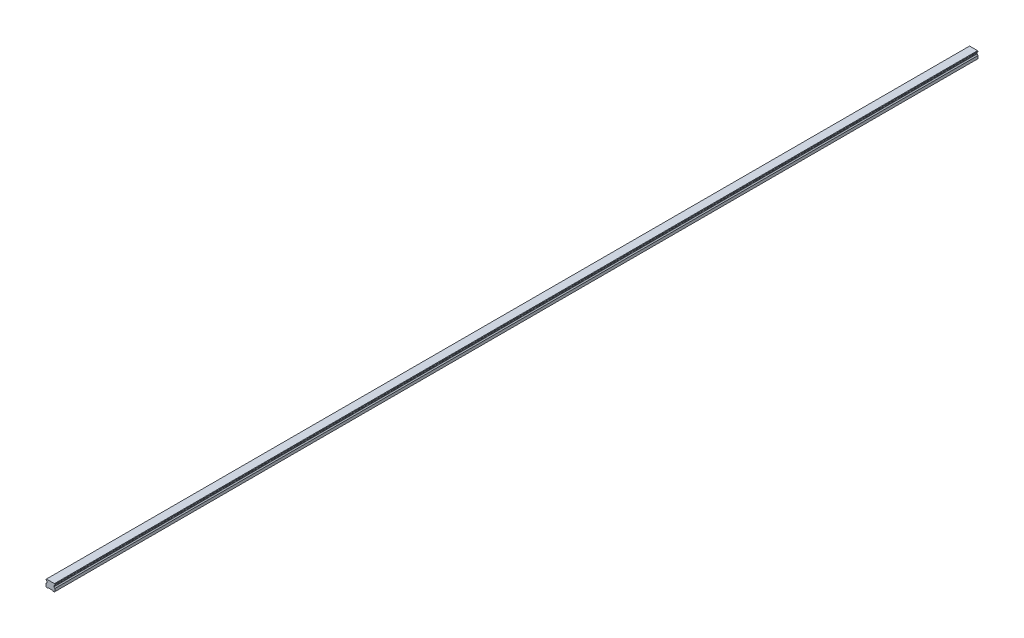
from build123d import *

# Parameters (mm, degrees)
SKETCH1_W           = 20
SKETCH1_H           = 16.3
BOSS_EXTRUDE1_DEPTH = 1040
CUT_EXTRUDE1_DEPTH  = 2081.087904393
CHAMFER1_SIZE       = 1
FILLET1_R           = 1
CUT_EXTRUDE2_DEPTH  = 2081.087904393
SKETCH5_R           = 3
SKETCH5_R_2         = 2.5
CUT_EXTRUDE5_DEPTH  = 10
SKETCH5_2_R         = 2.5
CUT_EXTRUDE6_DEPTH  = 13
LPATTERN2_COUNT     = 35
LPATTERN2_PITCH     = 60


with BuildPart() as part:
    # Sketch1 → Boss-Extrude1 (new, symmetric)
    with BuildSketch(Plane.XY):
        with Locations((0, 8.15)):
            Rectangle(SKETCH1_W, SKETCH1_H)
    extrude(amount=BOSS_EXTRUDE1_DEPTH, both=True)

    # Sketch2 → Cut-Extrude1 (cut, through all)
    with BuildSketch(Plane.XY.offset(1040)):
        Polygon((-10, 14.3), (-10, 7.3), (-7.666666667, 9.633333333), (-7.666666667, 11.966666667), align=None)
        Polygon((7.666666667, 11.966666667), (10, 14.3), (10, 7.3), (7.666666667, 9.633333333), align=None)
    extrude(amount=-CUT_EXTRUDE1_DEPTH, mode=Mode.SUBTRACT)

    # Chamfer1
    chamfer1_edges = [part.edges().sort_by_distance(p)[0] for p in [
        (-10, 16.3, 0),
        (10, 16.3, 0),
        (10, 0, 0),
        (-10, 0, 0),
    ]]
    chamfer(chamfer1_edges, length=CHAMFER1_SIZE)

    # Fillet1
    fillet1_edges = [part.edges().sort_by_distance(p)[0] for p in [
        (-7.666666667, 11.966666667, 0),
        (-7.666666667, 9.633333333, 0),
        (7.666666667, 9.633333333, 0),
        (7.666666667, 11.966666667, 0),
    ]]
    fillet(fillet1_edges, radius=FILLET1_R)

    # Sketch3 → Cut-Extrude2 (cut, through all)
    with BuildSketch(Plane.XY.offset(1040)):
        Polygon((-6, 0), (-5, 1), (5, 1), (6, 0), align=None)
    extrude(amount=-CUT_EXTRUDE2_DEPTH, mode=Mode.SUBTRACT)

    # Sketch5 → Cut-Extrude5 (cut)
    with BuildSketch(Plane.XZ.offset(-1)):
        with Locations(Location((0, 1020, 0), (0, 0, 270))):
            Circle(SKETCH5_R)
        with Locations(Location((0, 1020, 0), (0, 0, 270))):
            Circle(SKETCH5_R_2, mode=Mode.SUBTRACT)
    cut_extrude5 = extrude(amount=-CUT_EXTRUDE5_DEPTH, mode=Mode.SUBTRACT)

    # Sketch5_2 → Cut-Extrude6 (cut)
    with BuildSketch(Plane.XZ.offset(-1)):
        with Locations(Location((0, 1020, 0), (0, 0, 270))):
            Circle(SKETCH5_2_R)
    cut_extrude6 = extrude(amount=-CUT_EXTRUDE6_DEPTH, mode=Mode.SUBTRACT)

    # Cut-Extrude7 cone 1 section (on through the dimple's axis) → Cut-Extrude7 (revolve, cut)
    with BuildSketch(Plane(origin=(0, 14, 1020), x_dir=(0, 0, -1), z_dir=(1, 0, 0))):
        Polygon((0, 0), (2.5, 0), (0, 1.443375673), align=None)
    cut_extrude7 = revolve(axis=Axis((0, 14, 1020), (0, 1, 0)), mode=Mode.SUBTRACT)

    # LPattern2: Cut-Extrude5, Cut-Extrude6, Cut-Extrude7 ×35
    with Locations(*[(0, 0, -i * LPATTERN2_PITCH) for i in range(1, LPATTERN2_COUNT)]):
        add(cut_extrude5, mode=Mode.SUBTRACT)
        add(cut_extrude6, mode=Mode.SUBTRACT)
        add(cut_extrude7, mode=Mode.SUBTRACT)


solid = part.part
